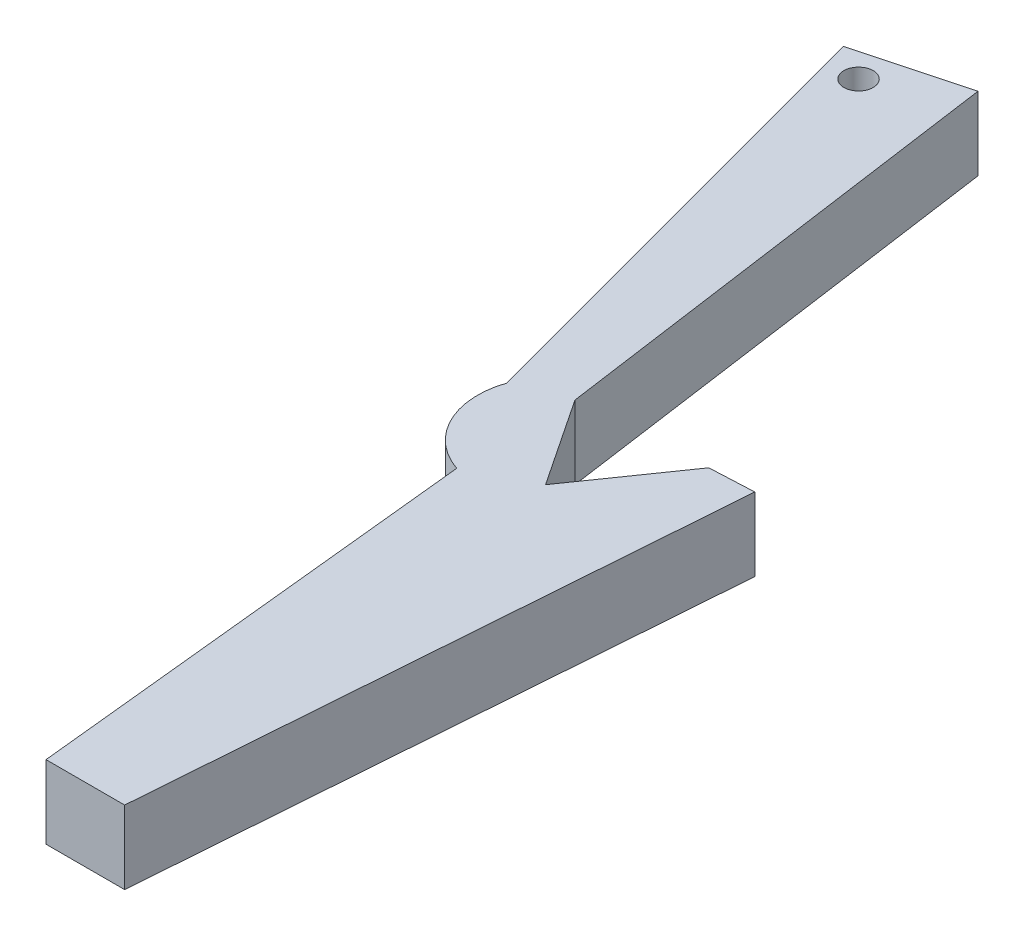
ISO-10303-21;
HEADER;
FILE_DESCRIPTION(('STEP AP214'),'2;1');
FILE_NAME('part.step','',(''),(''),'','','');
FILE_SCHEMA(('AUTOMOTIVE_DESIGN { 1 0 10303 214 1 1 1 1 }'));
ENDSEC;
DATA;
#1=APPLICATION_CONTEXT('core data for automotive mechanical design processes');
#2=APPLICATION_PROTOCOL_DEFINITION('international standard','automotive_design',2000,#1);
#3=PRODUCT_CONTEXT('',#1,'mechanical');
#4=PRODUCT('Part','Part','',(#3));
#5=PRODUCT_RELATED_PRODUCT_CATEGORY('part','',(#4));
#6=PRODUCT_DEFINITION_FORMATION('','',#4);
#7=PRODUCT_DEFINITION_CONTEXT('part definition',#1,'design');
#8=PRODUCT_DEFINITION('design','',#6,#7);
#9=PRODUCT_DEFINITION_SHAPE('','',#8);
#10=(LENGTH_UNIT() NAMED_UNIT(*) SI_UNIT(.MILLI.,.METRE.));
#11=(NAMED_UNIT(*) PLANE_ANGLE_UNIT() SI_UNIT($,.RADIAN.));
#12=(NAMED_UNIT(*) SI_UNIT($,.STERADIAN.) SOLID_ANGLE_UNIT());
#13=UNCERTAINTY_MEASURE_WITH_UNIT(LENGTH_MEASURE(1.E-05),#10,'distance_accuracy_value','');
#14=(GEOMETRIC_REPRESENTATION_CONTEXT(3) GLOBAL_UNCERTAINTY_ASSIGNED_CONTEXT((#13)) GLOBAL_UNIT_ASSIGNED_CONTEXT((#10,
#11,#12)) REPRESENTATION_CONTEXT('',''));
#15=CARTESIAN_POINT('',(0.,0.,0.));
#16=DIRECTION('',(0.,0.,1.));
#17=DIRECTION('',(1.,0.,0.));
#18=AXIS2_PLACEMENT_3D('',#15,#16,#17);
#19=CARTESIAN_POINT('',(37.5158205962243,10.,-43.7630271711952));
#20=DIRECTION('',(-0.990268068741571,0.,0.139173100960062));
#21=DIRECTION('',(0.139173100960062,0.,0.990268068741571));
#22=AXIS2_PLACEMENT_3D('',#19,#20,#21);
#23=PLANE('',#22);
#24=DIRECTION('',(-0.139173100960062,0.,-0.990268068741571));
#25=VECTOR('',#24,1.);
#26=CARTESIAN_POINT('',(37.5158205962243,0.,-43.7630271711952));
#27=LINE('',#26,#25);
#28=CARTESIAN_POINT('',(46.5104340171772,0.,20.2369728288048));
#29=VERTEX_POINT('',#28);
#30=CARTESIAN_POINT('',(37.5158205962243,0.,-43.7630271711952));
#31=VERTEX_POINT('',#30);
#32=EDGE_CURVE('E156',#29,#31,#27,.T.);
#33=ORIENTED_EDGE('',*,*,#32,.T.);
#34=DIRECTION('',(0.,-1.,0.));
#35=VECTOR('',#34,1.);
#36=CARTESIAN_POINT('',(37.5158205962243,10.,-43.7630271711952));
#37=LINE('',#36,#35);
#38=CARTESIAN_POINT('',(37.5158205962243,10.,-43.7630271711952));
#39=VERTEX_POINT('',#38);
#40=EDGE_CURVE('E11',#39,#31,#37,.T.);
#41=ORIENTED_EDGE('',*,*,#40,.F.);
#42=DIRECTION('',(-0.139173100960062,0.,-0.990268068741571));
#43=VECTOR('',#42,1.);
#44=CARTESIAN_POINT('',(37.5158205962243,10.,-43.7630271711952));
#45=LINE('',#44,#43);
#46=CARTESIAN_POINT('',(46.5104340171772,10.,20.2369728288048));
#47=VERTEX_POINT('',#46);
#48=EDGE_CURVE('E185',#47,#39,#45,.T.);
#49=ORIENTED_EDGE('',*,*,#48,.F.);
#50=DIRECTION('',(0.,-1.,0.));
#51=VECTOR('',#50,1.);
#52=CARTESIAN_POINT('',(46.5104340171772,10.,20.2369728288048));
#53=LINE('',#52,#51);
#54=EDGE_CURVE('E152',#47,#29,#53,.T.);
#55=ORIENTED_EDGE('',*,*,#54,.T.);
#56=EDGE_LOOP('',(#33,#41,#49,#55));
#57=FACE_BOUND('',#56,.T.);
#58=ADVANCED_FACE('F43',(#57),#23,.F.);
#59=CARTESIAN_POINT('',(37.5158205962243,10.,-43.7630271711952));
#60=DIRECTION('',(0.258819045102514,0.,0.96592582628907));
#61=DIRECTION('',(0.96592582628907,0.,-0.258819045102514));
#62=AXIS2_PLACEMENT_3D('',#59,#60,#61);
#63=PLANE('',#62);
#64=DIRECTION('',(-0.96592582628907,0.,0.258819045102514));
#65=VECTOR('',#64,1.);
#66=CARTESIAN_POINT('',(37.5158205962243,0.,-43.7630271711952));
#67=LINE('',#66,#65);
#68=CARTESIAN_POINT('',(23.0269332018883,0.,-39.8807414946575));
#69=VERTEX_POINT('',#68);
#70=EDGE_CURVE('E160',#31,#69,#67,.T.);
#71=ORIENTED_EDGE('',*,*,#70,.T.);
#72=DIRECTION('',(0.,-1.,0.));
#73=VECTOR('',#72,1.);
#74=CARTESIAN_POINT('',(23.0269332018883,10.,-39.8807414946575));
#75=LINE('',#74,#73);
#76=CARTESIAN_POINT('',(23.0269332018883,10.,-39.8807414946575));
#77=VERTEX_POINT('',#76);
#78=EDGE_CURVE('E52',#77,#69,#75,.T.);
#79=ORIENTED_EDGE('',*,*,#78,.F.);
#80=DIRECTION('',(-0.96592582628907,0.,0.258819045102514));
#81=VECTOR('',#80,1.);
#82=CARTESIAN_POINT('',(37.5158205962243,10.,-43.7630271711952));
#83=LINE('',#82,#81);
#84=EDGE_CURVE('E109',#39,#77,#83,.T.);
#85=ORIENTED_EDGE('',*,*,#84,.F.);
#86=ORIENTED_EDGE('',*,*,#40,.T.);
#87=EDGE_LOOP('',(#71,#79,#85,#86));
#88=FACE_BOUND('',#87,.T.);
#89=ADVANCED_FACE('F272',(#88),#63,.F.);
#90=CARTESIAN_POINT('',(23.0269332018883,10.,-39.8807414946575));
#91=DIRECTION('',(0.96592582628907,0.,-0.258819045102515));
#92=DIRECTION('',(-0.258819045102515,0.,-0.96592582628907));
#93=AXIS2_PLACEMENT_3D('',#90,#91,#92);
#94=PLANE('',#93);
#95=DIRECTION('',(0.258819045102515,0.,0.96592582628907));
#96=VECTOR('',#95,1.);
#97=CARTESIAN_POINT('',(23.0269332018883,0.,-39.8807414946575));
#98=LINE('',#97,#96);
#99=CARTESIAN_POINT('',(39.8501711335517,0.,22.904437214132));
#100=VERTEX_POINT('',#99);
#101=EDGE_CURVE('E164',#69,#100,#98,.T.);
#102=ORIENTED_EDGE('',*,*,#101,.T.);
#103=DIRECTION('',(0.,-1.,0.));
#104=VECTOR('',#103,1.);
#105=CARTESIAN_POINT('',(39.8501711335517,10.,22.904437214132));
#106=LINE('',#105,#104);
#107=CARTESIAN_POINT('',(39.8501711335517,10.,22.904437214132));
#108=VERTEX_POINT('',#107);
#109=EDGE_CURVE('E204',#108,#100,#106,.T.);
#110=ORIENTED_EDGE('',*,*,#109,.F.);
#111=DIRECTION('',(0.258819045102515,0.,0.96592582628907));
#112=VECTOR('',#111,1.);
#113=CARTESIAN_POINT('',(23.0269332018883,10.,-39.8807414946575));
#114=LINE('',#113,#112);
#115=EDGE_CURVE('E214',#77,#108,#114,.T.);
#116=ORIENTED_EDGE('',*,*,#115,.F.);
#117=ORIENTED_EDGE('',*,*,#78,.T.);
#118=EDGE_LOOP('',(#102,#110,#116,#117));
#119=FACE_BOUND('',#118,.T.);
#120=ADVANCED_FACE('F212',(#119),#94,.F.);
#121=CARTESIAN_POINT('',(49.9159275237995,10.,26.3099307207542));
#122=DIRECTION('',(0.,-1.,0.));
#123=DIRECTION('',(0.,0.,-1.));
#124=AXIS2_PLACEMENT_3D('',#121,#122,#123);
#125=CYLINDRICAL_SURFACE('',#124,10.6262334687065);
#126=CARTESIAN_POINT('',(49.9159275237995,0.,26.3099307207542));
#127=DIRECTION('',(0.,1.,0.));
#128=DIRECTION('',(0.,0.,1.));
#129=AXIS2_PLACEMENT_3D('',#126,#127,#128);
#130=CIRCLE('',#129,10.6262334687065);
#131=CARTESIAN_POINT('',(46.5104340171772,0.,36.3756871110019));
#132=VERTEX_POINT('',#131);
#133=EDGE_CURVE('E167',#100,#132,#130,.T.);
#134=ORIENTED_EDGE('',*,*,#133,.T.);
#135=DIRECTION('',(0.,-1.,0.));
#136=VECTOR('',#135,1.);
#137=CARTESIAN_POINT('',(46.5104340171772,10.,36.3756871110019));
#138=LINE('',#137,#136);
#139=CARTESIAN_POINT('',(46.5104340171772,10.,36.3756871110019));
#140=VERTEX_POINT('',#139);
#141=EDGE_CURVE('E200',#140,#132,#138,.T.);
#142=ORIENTED_EDGE('',*,*,#141,.F.);
#143=CARTESIAN_POINT('',(49.9159275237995,10.,26.3099307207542));
#144=DIRECTION('',(0.,1.,0.));
#145=DIRECTION('',(0.,0.,1.));
#146=AXIS2_PLACEMENT_3D('',#143,#144,#145);
#147=CIRCLE('',#146,10.6262334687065);
#148=EDGE_CURVE('E233',#108,#140,#147,.T.);
#149=ORIENTED_EDGE('',*,*,#148,.F.);
#150=ORIENTED_EDGE('',*,*,#109,.T.);
#151=EDGE_LOOP('',(#134,#142,#149,#150));
#152=FACE_BOUND('',#151,.T.);
#153=ADVANCED_FACE('F223',(#152),#125,.T.);
#154=CARTESIAN_POINT('',(52.9155736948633,10.,98.8309132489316));
#155=DIRECTION('',(0.994782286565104,0.,-0.10202059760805));
#156=DIRECTION('',(-0.10202059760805,0.,-0.994782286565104));
#157=AXIS2_PLACEMENT_3D('',#154,#155,#156);
#158=PLANE('',#157);
#159=DIRECTION('',(0.10202059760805,0.,0.994782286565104));
#160=VECTOR('',#159,1.);
#161=CARTESIAN_POINT('',(52.9155736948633,0.,98.8309132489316));
#162=LINE('',#161,#160);
#163=CARTESIAN_POINT('',(52.9155736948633,0.,98.8309132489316));
#164=VERTEX_POINT('',#163);
#165=EDGE_CURVE('E170',#132,#164,#162,.T.);
#166=ORIENTED_EDGE('',*,*,#165,.T.);
#167=DIRECTION('',(0.,-1.,0.));
#168=VECTOR('',#167,1.);
#169=CARTESIAN_POINT('',(52.9155736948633,10.,98.8309132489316));
#170=LINE('',#169,#168);
#171=CARTESIAN_POINT('',(52.9155736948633,10.,98.8309132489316));
#172=VERTEX_POINT('',#171);
#173=EDGE_CURVE('E196',#172,#164,#170,.T.);
#174=ORIENTED_EDGE('',*,*,#173,.F.);
#175=DIRECTION('',(0.10202059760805,0.,0.994782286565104));
#176=VECTOR('',#175,1.);
#177=CARTESIAN_POINT('',(52.9155736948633,10.,98.8309132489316));
#178=LINE('',#177,#176);
#179=EDGE_CURVE('E229',#140,#172,#178,.T.);
#180=ORIENTED_EDGE('',*,*,#179,.F.);
#181=ORIENTED_EDGE('',*,*,#141,.T.);
#182=EDGE_LOOP('',(#166,#174,#180,#181));
#183=FACE_BOUND('',#182,.T.);
#184=ADVANCED_FACE('F227',(#183),#158,.F.);
#185=CARTESIAN_POINT('',(63.6492759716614,10.,98.8309132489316));
#186=DIRECTION('',(0.,0.,-1.));
#187=DIRECTION('',(-1.,0.,0.));
#188=AXIS2_PLACEMENT_3D('',#185,#186,#187);
#189=PLANE('',#188);
#190=DIRECTION('',(1.,0.,0.));
#191=VECTOR('',#190,1.);
#192=CARTESIAN_POINT('',(63.6492759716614,0.,98.8309132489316));
#193=LINE('',#192,#191);
#194=CARTESIAN_POINT('',(63.6492759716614,0.,98.8309132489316));
#195=VERTEX_POINT('',#194);
#196=EDGE_CURVE('E173',#164,#195,#193,.T.);
#197=ORIENTED_EDGE('',*,*,#196,.T.);
#198=DIRECTION('',(0.,-1.,0.));
#199=VECTOR('',#198,1.);
#200=CARTESIAN_POINT('',(63.6492759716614,10.,98.8309132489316));
#201=LINE('',#200,#199);
#202=CARTESIAN_POINT('',(63.6492759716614,10.,98.8309132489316));
#203=VERTEX_POINT('',#202);
#204=EDGE_CURVE('E192',#203,#195,#201,.T.);
#205=ORIENTED_EDGE('',*,*,#204,.F.);
#206=DIRECTION('',(1.,0.,0.));
#207=VECTOR('',#206,1.);
#208=CARTESIAN_POINT('',(63.6492759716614,10.,98.8309132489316));
#209=LINE('',#208,#207);
#210=EDGE_CURVE('E232',#172,#203,#209,.T.);
#211=ORIENTED_EDGE('',*,*,#210,.F.);
#212=ORIENTED_EDGE('',*,*,#173,.T.);
#213=EDGE_LOOP('',(#197,#205,#211,#212));
#214=FACE_BOUND('',#213,.T.);
#215=ADVANCED_FACE('F284',(#214),#189,.F.);
#216=CARTESIAN_POINT('',(69.6492759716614,10.,18.8309132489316));
#217=DIRECTION('',(-0.997199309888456,0.,-0.0747899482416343));
#218=DIRECTION('',(-0.0747899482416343,0.,0.997199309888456));
#219=AXIS2_PLACEMENT_3D('',#216,#217,#218);
#220=PLANE('',#219);
#221=DIRECTION('',(0.0747899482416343,0.,-0.997199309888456));
#222=VECTOR('',#221,1.);
#223=CARTESIAN_POINT('',(69.6492759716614,0.,18.8309132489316));
#224=LINE('',#223,#222);
#225=CARTESIAN_POINT('',(69.6492759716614,0.,18.8309132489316));
#226=VERTEX_POINT('',#225);
#227=EDGE_CURVE('E176',#195,#226,#224,.T.);
#228=ORIENTED_EDGE('',*,*,#227,.T.);
#229=DIRECTION('',(0.,-1.,0.));
#230=VECTOR('',#229,1.);
#231=CARTESIAN_POINT('',(69.6492759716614,10.,18.8309132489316));
#232=LINE('',#231,#230);
#233=CARTESIAN_POINT('',(69.6492759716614,10.,18.8309132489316));
#234=VERTEX_POINT('',#233);
#235=EDGE_CURVE('E145',#234,#226,#232,.T.);
#236=ORIENTED_EDGE('',*,*,#235,.F.);
#237=DIRECTION('',(0.0747899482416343,0.,-0.997199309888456));
#238=VECTOR('',#237,1.);
#239=CARTESIAN_POINT('',(69.6492759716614,10.,18.8309132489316));
#240=LINE('',#239,#238);
#241=EDGE_CURVE('E134',#203,#234,#240,.T.);
#242=ORIENTED_EDGE('',*,*,#241,.F.);
#243=ORIENTED_EDGE('',*,*,#204,.T.);
#244=EDGE_LOOP('',(#228,#236,#242,#243));
#245=FACE_BOUND('',#244,.T.);
#246=ADVANCED_FACE('F281',(#245),#220,.F.);
#247=CARTESIAN_POINT('',(63.6492759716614,10.,19.1150044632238));
#248=DIRECTION('',(0.0472955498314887,0.,0.998880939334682));
#249=DIRECTION('',(0.998880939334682,0.,-0.0472955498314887));
#250=AXIS2_PLACEMENT_3D('',#247,#248,#249);
#251=PLANE('',#250);
#252=DIRECTION('',(-0.998880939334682,0.,0.0472955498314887));
#253=VECTOR('',#252,1.);
#254=CARTESIAN_POINT('',(63.6492759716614,0.,19.1150044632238));
#255=LINE('',#254,#253);
#256=CARTESIAN_POINT('',(63.6492759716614,0.,19.1150044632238));
#257=VERTEX_POINT('',#256);
#258=EDGE_CURVE('E143',#226,#257,#255,.T.);
#259=ORIENTED_EDGE('',*,*,#258,.T.);
#260=DIRECTION('',(0.,-1.,0.));
#261=VECTOR('',#260,1.);
#262=CARTESIAN_POINT('',(63.6492759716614,10.,19.1150044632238));
#263=LINE('',#262,#261);
#264=CARTESIAN_POINT('',(63.6492759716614,10.,19.1150044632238));
#265=VERTEX_POINT('',#264);
#266=EDGE_CURVE('E140',#265,#257,#263,.T.);
#267=ORIENTED_EDGE('',*,*,#266,.F.);
#268=DIRECTION('',(-0.998880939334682,0.,0.0472955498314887));
#269=VECTOR('',#268,1.);
#270=CARTESIAN_POINT('',(63.6492759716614,10.,19.1150044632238));
#271=LINE('',#270,#269);
#272=EDGE_CURVE('E128',#234,#265,#271,.T.);
#273=ORIENTED_EDGE('',*,*,#272,.F.);
#274=ORIENTED_EDGE('',*,*,#235,.T.);
#275=EDGE_LOOP('',(#259,#267,#273,#274));
#276=FACE_BOUND('',#275,.T.);
#277=ADVANCED_FACE('F141',(#276),#251,.F.);
#278=CARTESIAN_POINT('',(54.5104340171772,10.,32.2482282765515));
#279=DIRECTION('',(0.820826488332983,0.,0.571177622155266));
#280=DIRECTION('',(0.571177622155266,0.,-0.820826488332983));
#281=AXIS2_PLACEMENT_3D('',#278,#279,#280);
#282=PLANE('',#281);
#283=DIRECTION('',(-0.571177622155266,0.,0.820826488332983));
#284=VECTOR('',#283,1.);
#285=CARTESIAN_POINT('',(54.5104340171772,0.,32.2482282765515));
#286=LINE('',#285,#284);
#287=CARTESIAN_POINT('',(54.5104340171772,0.,32.2482282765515));
#288=VERTEX_POINT('',#287);
#289=EDGE_CURVE('E95',#257,#288,#286,.T.);
#290=ORIENTED_EDGE('',*,*,#289,.T.);
#291=DIRECTION('',(0.,-1.,0.));
#292=VECTOR('',#291,1.);
#293=CARTESIAN_POINT('',(54.5104340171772,10.,32.2482282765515));
#294=LINE('',#293,#292);
#295=CARTESIAN_POINT('',(54.5104340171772,10.,32.2482282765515));
#296=VERTEX_POINT('',#295);
#297=EDGE_CURVE('E146',#296,#288,#294,.T.);
#298=ORIENTED_EDGE('',*,*,#297,.F.);
#299=DIRECTION('',(-0.571177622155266,0.,0.820826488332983));
#300=VECTOR('',#299,1.);
#301=CARTESIAN_POINT('',(54.5104340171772,10.,32.2482282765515));
#302=LINE('',#301,#300);
#303=EDGE_CURVE('E132',#265,#296,#302,.T.);
#304=ORIENTED_EDGE('',*,*,#303,.F.);
#305=ORIENTED_EDGE('',*,*,#266,.T.);
#306=EDGE_LOOP('',(#290,#298,#304,#305));
#307=FACE_BOUND('',#306,.T.);
#308=ADVANCED_FACE('F148',(#307),#282,.F.);
#309=CARTESIAN_POINT('',(46.5104340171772,10.,20.2369728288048));
#310=DIRECTION('',(-0.832290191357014,0.,0.554340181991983));
#311=DIRECTION('',(0.554340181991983,0.,0.832290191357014));
#312=AXIS2_PLACEMENT_3D('',#309,#310,#311);
#313=PLANE('',#312);
#314=DIRECTION('',(-0.554340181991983,0.,-0.832290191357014));
#315=VECTOR('',#314,1.);
#316=CARTESIAN_POINT('',(46.5104340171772,0.,20.2369728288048));
#317=LINE('',#316,#315);
#318=EDGE_CURVE('E101',#288,#29,#317,.T.);
#319=ORIENTED_EDGE('',*,*,#318,.T.);
#320=ORIENTED_EDGE('',*,*,#54,.F.);
#321=DIRECTION('',(-0.554340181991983,0.,-0.832290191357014));
#322=VECTOR('',#321,1.);
#323=CARTESIAN_POINT('',(46.5104340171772,10.,20.2369728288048));
#324=LINE('',#323,#322);
#325=EDGE_CURVE('E60',#296,#47,#324,.T.);
#326=ORIENTED_EDGE('',*,*,#325,.F.);
#327=ORIENTED_EDGE('',*,*,#297,.T.);
#328=EDGE_LOOP('',(#319,#320,#326,#327));
#329=FACE_BOUND('',#328,.T.);
#330=ADVANCED_FACE('F263',(#329),#313,.F.);
#331=CARTESIAN_POINT('',(49.9159275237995,10.,26.3099307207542));
#332=DIRECTION('',(0.,1.,0.));
#333=DIRECTION('',(0.,0.,1.));
#334=AXIS2_PLACEMENT_3D('',#331,#332,#333);
#335=PLANE('',#334);
#336=CARTESIAN_POINT('',(27.9259126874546,10.,-37.0523143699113));
#337=DIRECTION('',(0.,1.,0.));
#338=DIRECTION('',(0.,0.,1.));
#339=AXIS2_PLACEMENT_3D('',#336,#337,#338);
#340=CIRCLE('',#339,2.);
#341=CARTESIAN_POINT('',(27.9259126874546,10.,-35.0523143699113));
#342=VERTEX_POINT('',#341);
#343=EDGE_CURVE('E247',#342,#342,#340,.T.);
#344=ORIENTED_EDGE('',*,*,#343,.F.);
#345=EDGE_LOOP('',(#344));
#346=FACE_BOUND('',#345,.T.);
#347=ORIENTED_EDGE('',*,*,#48,.T.);
#348=ORIENTED_EDGE('',*,*,#84,.T.);
#349=ORIENTED_EDGE('',*,*,#115,.T.);
#350=ORIENTED_EDGE('',*,*,#148,.T.);
#351=ORIENTED_EDGE('',*,*,#179,.T.);
#352=ORIENTED_EDGE('',*,*,#210,.T.);
#353=ORIENTED_EDGE('',*,*,#241,.T.);
#354=ORIENTED_EDGE('',*,*,#272,.T.);
#355=ORIENTED_EDGE('',*,*,#303,.T.);
#356=ORIENTED_EDGE('',*,*,#325,.T.);
#357=EDGE_LOOP('',(#347,#348,#349,#350,#351,#352,#353,#354,#355,#356));
#358=FACE_BOUND('',#357,.T.);
#359=ADVANCED_FACE('F130',(#346,#358),#335,.T.);
#360=CARTESIAN_POINT('',(49.9159275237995,0.,26.3099307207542));
#361=DIRECTION('',(0.,1.,0.));
#362=DIRECTION('',(0.,0.,1.));
#363=AXIS2_PLACEMENT_3D('',#360,#361,#362);
#364=PLANE('',#363);
#365=CARTESIAN_POINT('',(27.9259126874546,0.,-37.0523143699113));
#366=DIRECTION('',(0.,1.,0.));
#367=DIRECTION('',(0.,0.,1.));
#368=AXIS2_PLACEMENT_3D('',#365,#366,#367);
#369=CIRCLE('',#368,2.);
#370=CARTESIAN_POINT('',(27.9259126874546,0.,-35.0523143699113));
#371=VERTEX_POINT('',#370);
#372=EDGE_CURVE('E161',#371,#371,#369,.T.);
#373=ORIENTED_EDGE('',*,*,#372,.T.);
#374=EDGE_LOOP('',(#373));
#375=FACE_BOUND('',#374,.T.);
#376=ORIENTED_EDGE('',*,*,#32,.F.);
#377=ORIENTED_EDGE('',*,*,#318,.F.);
#378=ORIENTED_EDGE('',*,*,#289,.F.);
#379=ORIENTED_EDGE('',*,*,#258,.F.);
#380=ORIENTED_EDGE('',*,*,#227,.F.);
#381=ORIENTED_EDGE('',*,*,#196,.F.);
#382=ORIENTED_EDGE('',*,*,#165,.F.);
#383=ORIENTED_EDGE('',*,*,#133,.F.);
#384=ORIENTED_EDGE('',*,*,#101,.F.);
#385=ORIENTED_EDGE('',*,*,#70,.F.);
#386=EDGE_LOOP('',(#376,#377,#378,#379,#380,#381,#382,#383,#384,#385));
#387=FACE_BOUND('',#386,.T.);
#388=ADVANCED_FACE('F218',(#375,#387),#364,.F.);
#389=CARTESIAN_POINT('',(27.9259126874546,0.,-37.0523143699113));
#390=DIRECTION('',(0.,1.,0.));
#391=DIRECTION('',(0.,0.,1.));
#392=AXIS2_PLACEMENT_3D('',#389,#390,#391);
#393=CYLINDRICAL_SURFACE('',#392,2.);
#394=ORIENTED_EDGE('',*,*,#372,.F.);
#395=EDGE_LOOP('',(#394));
#396=FACE_BOUND('',#395,.T.);
#397=ORIENTED_EDGE('',*,*,#343,.T.);
#398=EDGE_LOOP('',(#397));
#399=FACE_BOUND('',#398,.T.);
#400=ADVANCED_FACE('F256',(#396,#399),#393,.F.);
#401=CLOSED_SHELL('',(#58,#89,#120,#153,#184,#215,#246,#277,#308,#330,#359,#388,#400));
#402=MANIFOLD_SOLID_BREP('B2',#401);
#403=ADVANCED_BREP_SHAPE_REPRESENTATION('',(#18,#402),#14);
#404=SHAPE_DEFINITION_REPRESENTATION(#9,#403);
ENDSEC;
END-ISO-10303-21;
